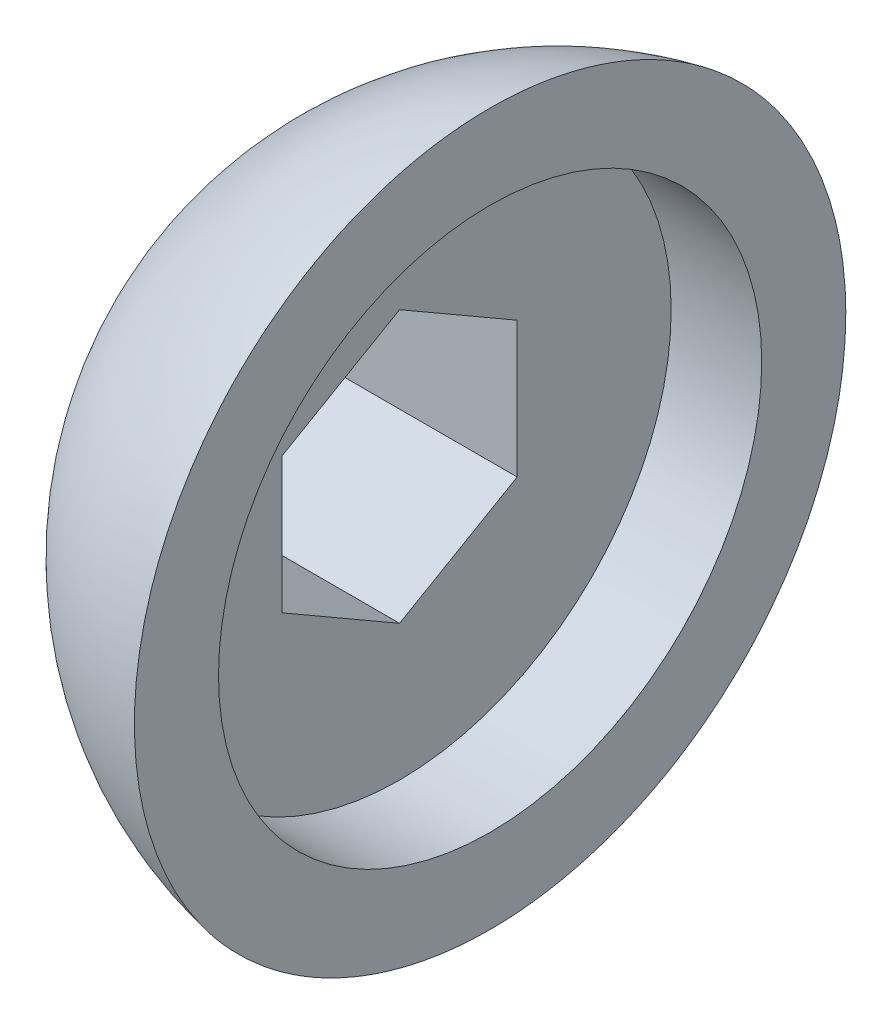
ISO-10303-21;
HEADER;
FILE_DESCRIPTION(('STEP AP214'),'2;1');
FILE_NAME('part.step','',(''),(''),'','','');
FILE_SCHEMA(('AUTOMOTIVE_DESIGN { 1 0 10303 214 1 1 1 1 }'));
ENDSEC;
DATA;
#1=APPLICATION_CONTEXT('core data for automotive mechanical design processes');
#2=APPLICATION_PROTOCOL_DEFINITION('international standard','automotive_design',2000,#1);
#3=PRODUCT_CONTEXT('',#1,'mechanical');
#4=PRODUCT('Part','Part','',(#3));
#5=PRODUCT_RELATED_PRODUCT_CATEGORY('part','',(#4));
#6=PRODUCT_DEFINITION_FORMATION('','',#4);
#7=PRODUCT_DEFINITION_CONTEXT('part definition',#1,'design');
#8=PRODUCT_DEFINITION('design','',#6,#7);
#9=PRODUCT_DEFINITION_SHAPE('','',#8);
#10=(LENGTH_UNIT() NAMED_UNIT(*) SI_UNIT(.MILLI.,.METRE.));
#11=(NAMED_UNIT(*) PLANE_ANGLE_UNIT() SI_UNIT($,.RADIAN.));
#12=(NAMED_UNIT(*) SI_UNIT($,.STERADIAN.) SOLID_ANGLE_UNIT());
#13=UNCERTAINTY_MEASURE_WITH_UNIT(LENGTH_MEASURE(1.E-05),#10,'distance_accuracy_value','');
#14=(GEOMETRIC_REPRESENTATION_CONTEXT(3) GLOBAL_UNCERTAINTY_ASSIGNED_CONTEXT((#13)) GLOBAL_UNIT_ASSIGNED_CONTEXT((#10,
#11,#12)) REPRESENTATION_CONTEXT('',''));
#15=CARTESIAN_POINT('',(0.,0.,0.));
#16=DIRECTION('',(0.,0.,1.));
#17=DIRECTION('',(1.,0.,0.));
#18=AXIS2_PLACEMENT_3D('',#15,#16,#17);
#19=CARTESIAN_POINT('',(1.92607341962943,0.952499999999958,1.64977839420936));
#20=DIRECTION('',(0.,0.,1.));
#21=DIRECTION('',(1.,0.,0.));
#22=AXIS2_PLACEMENT_3D('',#19,#20,#21);
#23=PLANE('',#22);
#24=DIRECTION('',(0.,1.,0.));
#25=VECTOR('',#24,1.);
#26=CARTESIAN_POINT('',(0.656073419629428,0.952499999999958,1.64977839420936));
#27=LINE('',#26,#25);
#28=CARTESIAN_POINT('',(0.656073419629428,-0.952500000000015,1.64977839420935));
#29=VERTEX_POINT('',#28);
#30=CARTESIAN_POINT('',(0.656073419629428,0.952499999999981,1.64977839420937));
#31=VERTEX_POINT('',#30);
#32=EDGE_CURVE('E90',#29,#31,#27,.T.);
#33=ORIENTED_EDGE('',*,*,#32,.F.);
#34=DIRECTION('',(1.,0.,0.));
#35=VECTOR('',#34,1.);
#36=CARTESIAN_POINT('',(1.92607341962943,-0.952500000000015,1.64977839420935));
#37=LINE('',#36,#35);
#38=CARTESIAN_POINT('',(-1.83071261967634,-0.952500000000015,1.64977839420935));
#39=VERTEX_POINT('',#38);
#40=EDGE_CURVE('E39',#29,#39,#37,.F.);
#41=ORIENTED_EDGE('',*,*,#40,.T.);
#42=CARTESIAN_POINT('',(-1.83071261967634,0.952499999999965,1.64977839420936));
#43=CARTESIAN_POINT('',(-1.84350674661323,0.889247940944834,1.64977839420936));
#44=CARTESIAN_POINT('',(-1.85502505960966,0.825737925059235,1.64977839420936));
#45=CARTESIAN_POINT('',(-1.87542994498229,0.698708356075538,1.64977839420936));
#46=CARTESIAN_POINT('',(-1.88433269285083,0.635191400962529,1.64977839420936));
#47=CARTESIAN_POINT('',(-1.89955229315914,0.508153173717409,1.64977839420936));
#48=CARTESIAN_POINT('',(-1.9058811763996,0.44463334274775,1.64977839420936));
#49=CARTESIAN_POINT('',(-1.91598737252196,0.31759315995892,1.64977839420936));
#50=CARTESIAN_POINT('',(-1.91977268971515,0.254073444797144,1.64977839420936));
#51=CARTESIAN_POINT('',(-1.92481369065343,0.127035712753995,1.64977839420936));
#52=CARTESIAN_POINT('',(-1.92607341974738,0.0635178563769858,1.64977839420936));
#53=CARTESIAN_POINT('',(-1.92607341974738,-0.0635178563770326,1.64977839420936));
#54=CARTESIAN_POINT('',(-1.92481369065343,-0.127035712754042,1.64977839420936));
#55=CARTESIAN_POINT('',(-1.91977268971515,-0.254073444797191,1.64977839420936));
#56=CARTESIAN_POINT('',(-1.91598737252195,-0.317593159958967,1.64977839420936));
#57=CARTESIAN_POINT('',(-1.9058811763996,-0.444633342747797,1.64977839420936));
#58=CARTESIAN_POINT('',(-1.89955229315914,-0.508153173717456,1.64977839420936));
#59=CARTESIAN_POINT('',(-1.88433269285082,-0.635191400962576,1.64977839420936));
#60=CARTESIAN_POINT('',(-1.87542994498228,-0.698708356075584,1.64977839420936));
#61=CARTESIAN_POINT('',(-1.85502505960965,-0.825737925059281,1.64977839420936));
#62=CARTESIAN_POINT('',(-1.84350674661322,-0.88924794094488,1.64977839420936));
#63=CARTESIAN_POINT('',(-1.83071261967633,-0.952500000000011,1.64977839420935));
#64=B_SPLINE_CURVE_WITH_KNOTS('',3,(#42,#43,#44,#45,#46,#47,#48,#49,#50,#51,#52,#53,#54,#55,#56,
#57,#58,#59,#60,#61,#62,#63),.UNSPECIFIED.,.F.,.F.,(4,2,2,2,2,2,2,2,2,2,4),(0.,
0.193585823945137,0.385947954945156,0.57740031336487,0.76824733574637,0.958788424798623,
1.14932951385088,1.34017653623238,1.53162889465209,1.72399102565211,1.91757684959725),.UNSPECIFIED.);
#65=CARTESIAN_POINT('',(-1.83071261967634,0.952499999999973,1.64977839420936));
#66=VERTEX_POINT('',#65);
#67=EDGE_CURVE('E173',#66,#39,#64,.T.);
#68=ORIENTED_EDGE('',*,*,#67,.F.);
#69=DIRECTION('',(1.,0.,0.));
#70=VECTOR('',#69,1.);
#71=CARTESIAN_POINT('',(1.92607341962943,0.952499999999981,1.64977839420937));
#72=LINE('',#71,#70);
#73=EDGE_CURVE('E81',#66,#31,#72,.T.);
#74=ORIENTED_EDGE('',*,*,#73,.T.);
#75=EDGE_LOOP('',(#33,#41,#68,#74));
#76=FACE_BOUND('',#75,.T.);
#77=ADVANCED_FACE('F33',(#76),#23,.F.);
#78=CARTESIAN_POINT('',(1.92607341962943,-0.952500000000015,1.64977839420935));
#79=DIRECTION('',(0.,-0.866025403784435,0.500000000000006));
#80=DIRECTION('',(0.,-0.500000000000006,-0.866025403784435));
#81=AXIS2_PLACEMENT_3D('',#78,#79,#80);
#82=PLANE('',#81);
#83=DIRECTION('',(0.,0.500000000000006,0.866025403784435));
#84=VECTOR('',#83,1.);
#85=CARTESIAN_POINT('',(0.656073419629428,-0.952500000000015,1.64977839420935));
#86=LINE('',#85,#84);
#87=CARTESIAN_POINT('',(0.656073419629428,-1.90500000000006,0.));
#88=VERTEX_POINT('',#87);
#89=EDGE_CURVE('E87',#88,#29,#86,.T.);
#90=ORIENTED_EDGE('',*,*,#89,.F.);
#91=DIRECTION('',(1.,0.,0.));
#92=VECTOR('',#91,1.);
#93=CARTESIAN_POINT('',(1.92607341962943,-1.90500000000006,0.));
#94=LINE('',#93,#92);
#95=CARTESIAN_POINT('',(-1.83071261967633,-1.90500000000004,0.));
#96=VERTEX_POINT('',#95);
#97=EDGE_CURVE('E172',#88,#96,#94,.F.);
#98=ORIENTED_EDGE('',*,*,#97,.T.);
#99=CARTESIAN_POINT('',(-1.83071261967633,-0.952500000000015,1.64977839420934));
#100=CARTESIAN_POINT('',(-1.84350674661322,-0.984126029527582,1.59500050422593));
#101=CARTESIAN_POINT('',(-1.85502505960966,-1.01588103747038,1.53999921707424));
#102=CARTESIAN_POINT('',(-1.87542994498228,-1.07939582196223,1.42998838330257));
#103=CARTESIAN_POINT('',(-1.88433269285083,-1.11115429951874,1.37498108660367));
#104=CARTESIAN_POINT('',(-1.89955229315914,-1.1746734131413,1.26496275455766));
#105=CARTESIAN_POINT('',(-1.9058811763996,-1.20643332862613,1.20995296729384));
#106=CARTESIAN_POINT('',(-1.91598737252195,-1.26995342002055,1.09993294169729));
#107=CARTESIAN_POINT('',(-1.91977268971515,-1.30171327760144,1.04492325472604));
#108=CARTESIAN_POINT('',(-1.92481369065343,-1.36523214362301,0.934905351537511));
#109=CARTESIAN_POINT('',(-1.92607341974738,-1.39699107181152,0.879897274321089));
#110=CARTESIAN_POINT('',(-1.92607341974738,-1.46050892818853,0.769881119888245));
#111=CARTESIAN_POINT('',(-1.92481369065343,-1.49226785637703,0.714873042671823));
#112=CARTESIAN_POINT('',(-1.91977268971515,-1.55578672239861,0.604855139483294));
#113=CARTESIAN_POINT('',(-1.91598737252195,-1.5875465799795,0.549845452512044));
#114=CARTESIAN_POINT('',(-1.90588117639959,-1.65106667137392,0.439825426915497));
#115=CARTESIAN_POINT('',(-1.89955229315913,-1.68282658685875,0.384815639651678));
#116=CARTESIAN_POINT('',(-1.88433269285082,-1.74634570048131,0.274797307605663));
#117=CARTESIAN_POINT('',(-1.87542994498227,-1.77810417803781,0.219790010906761));
#118=CARTESIAN_POINT('',(-1.85502505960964,-1.84161896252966,0.109779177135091));
#119=CARTESIAN_POINT('',(-1.84350674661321,-1.87337397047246,0.0547778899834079));
#120=CARTESIAN_POINT('',(-1.83071261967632,-1.90500000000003,0.));
#121=B_SPLINE_CURVE_WITH_KNOTS('',3,(#99,#100,#101,#102,#103,#104,#105,#106,#107,#108,#109,#110,
#111,#112,#113,#114,#115,#116,#117,#118,#119,#120),.UNSPECIFIED.,.F.,.F.,(4,2,2,2,2,2,2,2,2,2,
4),(0.,0.19358582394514,0.385947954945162,0.577400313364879,0.768247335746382,0.958788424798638,
1.14932951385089,1.3401765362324,1.53162889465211,1.72399102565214,1.91757684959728),.UNSPECIFIED.);
#122=EDGE_CURVE('E166',#39,#96,#121,.T.);
#123=ORIENTED_EDGE('',*,*,#122,.F.);
#124=ORIENTED_EDGE('',*,*,#40,.F.);
#125=EDGE_LOOP('',(#90,#98,#123,#124));
#126=FACE_BOUND('',#125,.T.);
#127=ADVANCED_FACE('F178',(#126),#82,.F.);
#128=CARTESIAN_POINT('',(1.92607341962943,1.905,0.));
#129=DIRECTION('',(0.,0.866025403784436,0.500000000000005));
#130=DIRECTION('',(0.,-0.500000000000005,0.866025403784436));
#131=AXIS2_PLACEMENT_3D('',#128,#129,#130);
#132=PLANE('',#131);
#133=DIRECTION('',(0.,0.500000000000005,-0.866025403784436));
#134=VECTOR('',#133,1.);
#135=CARTESIAN_POINT('',(0.656073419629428,1.905,0.));
#136=LINE('',#135,#134);
#137=CARTESIAN_POINT('',(0.656073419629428,1.90499999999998,0.));
#138=VERTEX_POINT('',#137);
#139=EDGE_CURVE('E52',#31,#138,#136,.T.);
#140=ORIENTED_EDGE('',*,*,#139,.F.);
#141=ORIENTED_EDGE('',*,*,#73,.F.);
#142=CARTESIAN_POINT('',(-1.83071261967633,1.905,0.));
#143=CARTESIAN_POINT('',(-1.84350674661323,1.87337397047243,0.0547778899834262));
#144=CARTESIAN_POINT('',(-1.85502505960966,1.84161896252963,0.109779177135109));
#145=CARTESIAN_POINT('',(-1.87542994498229,1.77810417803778,0.21979001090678));
#146=CARTESIAN_POINT('',(-1.88433269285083,1.74634570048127,0.274797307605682));
#147=CARTESIAN_POINT('',(-1.89955229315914,1.68282658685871,0.384815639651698));
#148=CARTESIAN_POINT('',(-1.9058811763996,1.65106667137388,0.439825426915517));
#149=CARTESIAN_POINT('',(-1.91598737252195,1.58754657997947,0.549845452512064));
#150=CARTESIAN_POINT('',(-1.91977268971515,1.55578672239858,0.604855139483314));
#151=CARTESIAN_POINT('',(-1.92481369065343,1.492267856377,0.714873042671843));
#152=CARTESIAN_POINT('',(-1.92607341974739,1.46050892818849,0.769881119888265));
#153=CARTESIAN_POINT('',(-1.92607341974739,1.39699107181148,0.87989727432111));
#154=CARTESIAN_POINT('',(-1.92481369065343,1.36523214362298,0.934905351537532));
#155=CARTESIAN_POINT('',(-1.91977268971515,1.3017132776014,1.04492325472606));
#156=CARTESIAN_POINT('',(-1.91598737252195,1.26995342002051,1.09993294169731));
#157=CARTESIAN_POINT('',(-1.9058811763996,1.2064333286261,1.20995296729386));
#158=CARTESIAN_POINT('',(-1.89955229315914,1.17467341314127,1.26496275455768));
#159=CARTESIAN_POINT('',(-1.88433269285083,1.1111542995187,1.37498108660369));
#160=CARTESIAN_POINT('',(-1.87542994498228,1.0793958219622,1.42998838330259));
#161=CARTESIAN_POINT('',(-1.85502505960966,1.01588103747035,1.53999921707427));
#162=CARTESIAN_POINT('',(-1.84350674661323,0.984126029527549,1.59500050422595));
#163=CARTESIAN_POINT('',(-1.83071261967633,0.952499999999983,1.64977839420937));
#164=B_SPLINE_CURVE_WITH_KNOTS('',3,(#142,#143,#144,#145,#146,#147,#148,#149,#150,#151,#152,
#153,#154,#155,#156,#157,#158,#159,#160,#161,#162,#163),.UNSPECIFIED.,.F.,.F.,(4,2,2,2,2,2,2,2,
2,2,4),(0.,0.19358582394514,0.385947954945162,0.57740031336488,0.768247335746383,
0.958788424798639,1.1493295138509,1.3401765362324,1.53162889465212,1.72399102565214,
1.91757684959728),.UNSPECIFIED.);
#165=CARTESIAN_POINT('',(-1.83071261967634,1.90499999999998,0.));
#166=VERTEX_POINT('',#165);
#167=EDGE_CURVE('E121',#166,#66,#164,.T.);
#168=ORIENTED_EDGE('',*,*,#167,.F.);
#169=DIRECTION('',(1.,0.,0.));
#170=VECTOR('',#169,1.);
#171=CARTESIAN_POINT('',(1.92607341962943,1.90499999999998,0.));
#172=LINE('',#171,#170);
#173=EDGE_CURVE('E113',#166,#138,#172,.T.);
#174=ORIENTED_EDGE('',*,*,#173,.T.);
#175=EDGE_LOOP('',(#140,#141,#168,#174));
#176=FACE_BOUND('',#175,.T.);
#177=ADVANCED_FACE('F156',(#176),#132,.F.);
#178=CARTESIAN_POINT('',(1.92607341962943,-1.90500000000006,0.));
#179=DIRECTION('',(0.,-0.866025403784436,-0.500000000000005));
#180=DIRECTION('',(0.,0.500000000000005,-0.866025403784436));
#181=AXIS2_PLACEMENT_3D('',#178,#179,#180);
#182=PLANE('',#181);
#183=DIRECTION('',(0.,-0.500000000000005,0.866025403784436));
#184=VECTOR('',#183,1.);
#185=CARTESIAN_POINT('',(0.656073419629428,-1.90500000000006,0.));
#186=LINE('',#185,#184);
#187=CARTESIAN_POINT('',(0.656073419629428,-0.952500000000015,-1.64977839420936));
#188=VERTEX_POINT('',#187);
#189=EDGE_CURVE('E106',#188,#88,#186,.T.);
#190=ORIENTED_EDGE('',*,*,#189,.F.);
#191=DIRECTION('',(-1.,0.,0.));
#192=VECTOR('',#191,1.);
#193=CARTESIAN_POINT('',(1.92607341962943,-0.952500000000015,-1.64977839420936));
#194=LINE('',#193,#192);
#195=CARTESIAN_POINT('',(-1.83071261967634,-0.952500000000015,-1.64977839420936));
#196=VERTEX_POINT('',#195);
#197=EDGE_CURVE('E105',#188,#196,#194,.T.);
#198=ORIENTED_EDGE('',*,*,#197,.T.);
#199=CARTESIAN_POINT('',(-1.83071261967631,-1.90500000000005,0.));
#200=CARTESIAN_POINT('',(-1.8435067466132,-1.87337397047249,-0.0547778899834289));
#201=CARTESIAN_POINT('',(-1.85502505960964,-1.84161896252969,-0.109779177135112));
#202=CARTESIAN_POINT('',(-1.87542994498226,-1.77810417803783,-0.219790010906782));
#203=CARTESIAN_POINT('',(-1.88433269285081,-1.74634570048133,-0.274797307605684));
#204=CARTESIAN_POINT('',(-1.89955229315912,-1.68282658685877,-0.3848156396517));
#205=CARTESIAN_POINT('',(-1.90588117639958,-1.65106667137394,-0.439825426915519));
#206=CARTESIAN_POINT('',(-1.91598737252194,-1.58754657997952,-0.549845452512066));
#207=CARTESIAN_POINT('',(-1.91977268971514,-1.55578672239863,-0.604855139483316));
#208=CARTESIAN_POINT('',(-1.92481369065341,-1.49226785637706,-0.714873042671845));
#209=CARTESIAN_POINT('',(-1.92607341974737,-1.46050892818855,-0.769881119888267));
#210=CARTESIAN_POINT('',(-1.92607341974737,-1.39699107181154,-0.879897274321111));
#211=CARTESIAN_POINT('',(-1.92481369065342,-1.36523214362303,-0.934905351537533));
#212=CARTESIAN_POINT('',(-1.91977268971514,-1.30171327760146,-1.04492325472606));
#213=CARTESIAN_POINT('',(-1.91598737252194,-1.26995342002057,-1.09993294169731));
#214=CARTESIAN_POINT('',(-1.90588117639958,-1.20643332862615,-1.20995296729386));
#215=CARTESIAN_POINT('',(-1.89955229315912,-1.17467341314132,-1.26496275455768));
#216=CARTESIAN_POINT('',(-1.88433269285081,-1.11115429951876,-1.37498108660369));
#217=CARTESIAN_POINT('',(-1.87542994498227,-1.07939582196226,-1.4299883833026));
#218=CARTESIAN_POINT('',(-1.85502505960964,-1.01588103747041,-1.53999921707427));
#219=CARTESIAN_POINT('',(-1.84350674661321,-0.984126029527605,-1.59500050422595));
#220=CARTESIAN_POINT('',(-1.83071261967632,-0.952500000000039,-1.64977839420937));
#221=B_SPLINE_CURVE_WITH_KNOTS('',3,(#199,#200,#201,#202,#203,#204,#205,#206,#207,#208,#209,
#210,#211,#212,#213,#214,#215,#216,#217,#218,#219,#220),.UNSPECIFIED.,.F.,.F.,(4,2,2,2,2,2,2,2,
2,2,4),(0.,0.19358582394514,0.385947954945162,0.57740031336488,0.768247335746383,
0.958788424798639,1.1493295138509,1.3401765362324,1.53162889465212,1.72399102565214,
1.91757684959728),.UNSPECIFIED.);
#222=EDGE_CURVE('E116',#96,#196,#221,.T.);
#223=ORIENTED_EDGE('',*,*,#222,.F.);
#224=ORIENTED_EDGE('',*,*,#97,.F.);
#225=EDGE_LOOP('',(#190,#198,#223,#224));
#226=FACE_BOUND('',#225,.T.);
#227=ADVANCED_FACE('F152',(#226),#182,.F.);
#228=CARTESIAN_POINT('',(1.92607341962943,-0.952500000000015,-1.64977839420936));
#229=DIRECTION('',(0.,0.,-1.));
#230=DIRECTION('',(-1.,0.,0.));
#231=AXIS2_PLACEMENT_3D('',#228,#229,#230);
#232=PLANE('',#231);
#233=DIRECTION('',(0.,-1.,0.));
#234=VECTOR('',#233,1.);
#235=CARTESIAN_POINT('',(0.656073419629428,-0.952500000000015,-1.64977839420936));
#236=LINE('',#235,#234);
#237=CARTESIAN_POINT('',(0.656073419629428,0.952499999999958,-1.64977839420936));
#238=VERTEX_POINT('',#237);
#239=EDGE_CURVE('E98',#238,#188,#236,.T.);
#240=ORIENTED_EDGE('',*,*,#239,.F.);
#241=DIRECTION('',(1.,0.,0.));
#242=VECTOR('',#241,1.);
#243=CARTESIAN_POINT('',(1.92607341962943,0.952499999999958,-1.64977839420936));
#244=LINE('',#243,#242);
#245=CARTESIAN_POINT('',(-1.83071261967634,0.952499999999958,-1.64977839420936));
#246=VERTEX_POINT('',#245);
#247=EDGE_CURVE('E61',#238,#246,#244,.F.);
#248=ORIENTED_EDGE('',*,*,#247,.T.);
#249=CARTESIAN_POINT('',(-1.83071261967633,-0.952500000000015,-1.64977839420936));
#250=CARTESIAN_POINT('',(-1.84350674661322,-0.889247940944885,-1.64977839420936));
#251=CARTESIAN_POINT('',(-1.85502505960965,-0.825737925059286,-1.64977839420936));
#252=CARTESIAN_POINT('',(-1.87542994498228,-0.698708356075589,-1.64977839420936));
#253=CARTESIAN_POINT('',(-1.88433269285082,-0.635191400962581,-1.64977839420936));
#254=CARTESIAN_POINT('',(-1.89955229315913,-0.508153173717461,-1.64977839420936));
#255=CARTESIAN_POINT('',(-1.9058811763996,-0.444633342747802,-1.64977839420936));
#256=CARTESIAN_POINT('',(-1.91598737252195,-0.317593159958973,-1.64977839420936));
#257=CARTESIAN_POINT('',(-1.91977268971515,-0.254073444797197,-1.64977839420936));
#258=CARTESIAN_POINT('',(-1.92481369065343,-0.127035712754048,-1.64977839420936));
#259=CARTESIAN_POINT('',(-1.92607341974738,-0.0635178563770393,-1.64977839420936));
#260=CARTESIAN_POINT('',(-1.92607341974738,0.063517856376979,-1.64977839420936));
#261=CARTESIAN_POINT('',(-1.92481369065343,0.127035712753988,-1.64977839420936));
#262=CARTESIAN_POINT('',(-1.91977268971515,0.254073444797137,-1.64977839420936));
#263=CARTESIAN_POINT('',(-1.91598737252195,0.317593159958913,-1.64977839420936));
#264=CARTESIAN_POINT('',(-1.9058811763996,0.444633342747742,-1.64977839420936));
#265=CARTESIAN_POINT('',(-1.89955229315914,0.508153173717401,-1.64977839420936));
#266=CARTESIAN_POINT('',(-1.88433269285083,0.635191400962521,-1.64977839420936));
#267=CARTESIAN_POINT('',(-1.87542994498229,0.69870835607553,-1.64977839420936));
#268=CARTESIAN_POINT('',(-1.85502505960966,0.825737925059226,-1.64977839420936));
#269=CARTESIAN_POINT('',(-1.84350674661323,0.889247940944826,-1.64977839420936));
#270=CARTESIAN_POINT('',(-1.83071261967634,0.952499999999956,-1.64977839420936));
#271=B_SPLINE_CURVE_WITH_KNOTS('',3,(#249,#250,#251,#252,#253,#254,#255,#256,#257,#258,#259,
#260,#261,#262,#263,#264,#265,#266,#267,#268,#269,#270),.UNSPECIFIED.,.F.,.F.,(4,2,2,2,2,2,2,2,
2,2,4),(0.,0.193585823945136,0.385947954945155,0.577400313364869,0.768247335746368,
0.958788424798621,1.14932951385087,1.34017653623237,1.53162889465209,1.7239910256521,
1.91757684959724),.UNSPECIFIED.);
#272=EDGE_CURVE('E140',#196,#246,#271,.T.);
#273=ORIENTED_EDGE('',*,*,#272,.F.);
#274=ORIENTED_EDGE('',*,*,#197,.F.);
#275=EDGE_LOOP('',(#240,#248,#273,#274));
#276=FACE_BOUND('',#275,.T.);
#277=ADVANCED_FACE('F104',(#276),#232,.F.);
#278=CARTESIAN_POINT('',(1.92607341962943,0.952499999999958,-1.64977839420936));
#279=DIRECTION('',(0.,0.866025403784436,-0.500000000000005));
#280=DIRECTION('',(0.,0.500000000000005,0.866025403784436));
#281=AXIS2_PLACEMENT_3D('',#278,#279,#280);
#282=PLANE('',#281);
#283=DIRECTION('',(0.,-0.500000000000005,-0.866025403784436));
#284=VECTOR('',#283,1.);
#285=CARTESIAN_POINT('',(0.656073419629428,0.952499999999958,-1.64977839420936));
#286=LINE('',#285,#284);
#287=EDGE_CURVE('E11',#138,#238,#286,.T.);
#288=ORIENTED_EDGE('',*,*,#287,.F.);
#289=ORIENTED_EDGE('',*,*,#173,.F.);
#290=CARTESIAN_POINT('',(-1.83071261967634,0.952499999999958,-1.64977839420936));
#291=CARTESIAN_POINT('',(-1.84350674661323,0.984126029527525,-1.59500050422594));
#292=CARTESIAN_POINT('',(-1.85502505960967,1.01588103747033,-1.53999921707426));
#293=CARTESIAN_POINT('',(-1.87542994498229,1.07939582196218,-1.42998838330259));
#294=CARTESIAN_POINT('',(-1.88433269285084,1.11115429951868,-1.37498108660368));
#295=CARTESIAN_POINT('',(-1.89955229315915,1.17467341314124,-1.26496275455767));
#296=CARTESIAN_POINT('',(-1.90588117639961,1.20643332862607,-1.20995296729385));
#297=CARTESIAN_POINT('',(-1.91598737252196,1.26995342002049,-1.0999329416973));
#298=CARTESIAN_POINT('',(-1.91977268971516,1.30171327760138,-1.04492325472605));
#299=CARTESIAN_POINT('',(-1.92481369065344,1.36523214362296,-0.93490535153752));
#300=CARTESIAN_POINT('',(-1.92607341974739,1.39699107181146,-0.879897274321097));
#301=CARTESIAN_POINT('',(-1.92607341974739,1.46050892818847,-0.769881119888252));
#302=CARTESIAN_POINT('',(-1.92481369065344,1.49226785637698,-0.714873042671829));
#303=CARTESIAN_POINT('',(-1.91977268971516,1.55578672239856,-0.6048551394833));
#304=CARTESIAN_POINT('',(-1.91598737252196,1.58754657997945,-0.549845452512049));
#305=CARTESIAN_POINT('',(-1.90588117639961,1.65106667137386,-0.439825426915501));
#306=CARTESIAN_POINT('',(-1.89955229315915,1.68282658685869,-0.384815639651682));
#307=CARTESIAN_POINT('',(-1.88433269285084,1.74634570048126,-0.274797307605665));
#308=CARTESIAN_POINT('',(-1.87542994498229,1.77810417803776,-0.219790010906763));
#309=CARTESIAN_POINT('',(-1.85502505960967,1.84161896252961,-0.109779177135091));
#310=CARTESIAN_POINT('',(-1.84350674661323,1.87337397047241,-0.0547778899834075));
#311=CARTESIAN_POINT('',(-1.83071261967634,1.90499999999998,0.));
#312=B_SPLINE_CURVE_WITH_KNOTS('',3,(#290,#291,#292,#293,#294,#295,#296,#297,#298,#299,#300,
#301,#302,#303,#304,#305,#306,#307,#308,#309,#310,#311),.UNSPECIFIED.,.F.,.F.,(4,2,2,2,2,2,2,2,
2,2,4),(0.,0.193585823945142,0.385947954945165,0.577400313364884,0.768247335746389,
0.958788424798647,1.14932951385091,1.34017653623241,1.53162889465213,1.72399102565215,
1.91757684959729),.UNSPECIFIED.);
#313=EDGE_CURVE('E45',#246,#166,#312,.T.);
#314=ORIENTED_EDGE('',*,*,#313,.F.);
#315=ORIENTED_EDGE('',*,*,#247,.F.);
#316=EDGE_LOOP('',(#288,#289,#314,#315));
#317=FACE_BOUND('',#316,.T.);
#318=ADVANCED_FACE('F109',(#317),#282,.F.);
#319=CARTESIAN_POINT('',(1.92607341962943,-0.461818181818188,0.));
#320=DIRECTION('',(1.,0.,0.));
#321=DIRECTION('',(0.,0.,-1.));
#322=AXIS2_PLACEMENT_3D('',#319,#320,#321);
#323=PLANE('',#322);
#324=CARTESIAN_POINT('',(1.92607341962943,-2.34289150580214E-10,0.));
#325=DIRECTION('',(1.,0.,0.));
#326=DIRECTION('',(0.,0.,-1.));
#327=AXIS2_PLACEMENT_3D('',#324,#325,#326);
#328=CIRCLE('',#327,3.81);
#329=CARTESIAN_POINT('',(1.92607341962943,-2.34289150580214E-10,-3.81));
#330=VERTEX_POINT('',#329);
#331=EDGE_CURVE('E209',#330,#330,#328,.T.);
#332=ORIENTED_EDGE('',*,*,#331,.F.);
#333=EDGE_LOOP('',(#332));
#334=FACE_BOUND('',#333,.T.);
#335=CARTESIAN_POINT('',(1.92607341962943,4.9899041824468,0.));
#336=CARTESIAN_POINT('',(1.92607341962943,4.98990478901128,-0.170465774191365));
#337=CARTESIAN_POINT('',(1.92607341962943,4.98116284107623,-0.34092210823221));
#338=CARTESIAN_POINT('',(1.92607341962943,4.94626927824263,-0.680188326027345));
#339=CARTESIAN_POINT('',(1.92607341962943,4.9201047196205,-0.848996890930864));
#340=CARTESIAN_POINT('',(1.92607341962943,4.85682965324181,-1.15326359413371));
#341=CARTESIAN_POINT('',(1.92607341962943,4.82249809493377,-1.28930750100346));
#342=CARTESIAN_POINT('',(1.92607341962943,4.74249125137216,-1.55806915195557));
#343=CARTESIAN_POINT('',(1.92607341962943,4.69681272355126,-1.69078593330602));
#344=CARTESIAN_POINT('',(1.92607341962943,4.5944039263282,-1.95199709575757));
#345=CARTESIAN_POINT('',(1.92607341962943,4.53766540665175,-2.08048824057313));
#346=CARTESIAN_POINT('',(1.92607341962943,4.41353914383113,-2.33227870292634));
#347=CARTESIAN_POINT('',(1.92607341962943,4.34614751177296,-2.45557610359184));
#348=CARTESIAN_POINT('',(1.92607341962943,4.20126701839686,-2.6959556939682));
#349=CARTESIAN_POINT('',(1.92607341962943,4.12378615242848,-2.81304270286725));
#350=CARTESIAN_POINT('',(1.92607341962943,3.95920639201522,-3.04031586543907));
#351=CARTESIAN_POINT('',(1.92607341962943,3.87210396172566,-3.15049945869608));
#352=CARTESIAN_POINT('',(1.92607341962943,3.68897912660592,-3.36307080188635));
#353=CARTESIAN_POINT('',(1.92607341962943,3.59296211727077,-3.46546319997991));
#354=CARTESIAN_POINT('',(1.92607341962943,3.39260916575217,-3.66183424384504));
#355=CARTESIAN_POINT('',(1.92607341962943,3.28827016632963,-3.75580977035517));
#356=CARTESIAN_POINT('',(1.92607341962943,3.07207474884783,-3.9346120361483));
#357=CARTESIAN_POINT('',(1.92607341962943,2.96022038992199,-4.01944126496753));
#358=CARTESIAN_POINT('',(1.92607341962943,2.72972424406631,-4.17940652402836));
#359=CARTESIAN_POINT('',(1.92607341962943,2.61107996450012,-4.25453896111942));
#360=CARTESIAN_POINT('',(1.92607341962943,2.36791389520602,-4.39451851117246));
#361=CARTESIAN_POINT('',(1.92607341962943,2.24339406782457,-4.45936902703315));
#362=CARTESIAN_POINT('',(1.92607341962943,1.98932220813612,-4.578367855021));
#363=CARTESIAN_POINT('',(1.92607341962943,1.85976830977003,-4.6325121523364));
#364=CARTESIAN_POINT('',(1.92607341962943,1.46504568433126,-4.77820896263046));
#365=CARTESIAN_POINT('',(1.92607341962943,1.19354633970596,-4.8531802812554));
#366=CARTESIAN_POINT('',(1.92607341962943,0.641808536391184,-4.9564092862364));
#367=CARTESIAN_POINT('',(1.92607341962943,0.361570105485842,-4.98466712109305));
#368=CARTESIAN_POINT('',(1.92607341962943,-0.0591235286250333,-4.99153389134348));
#369=CARTESIAN_POINT('',(1.92607341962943,-0.199486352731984,-4.9878912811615));
#370=CARTESIAN_POINT('',(1.92607341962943,-0.479388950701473,-4.96880010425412));
#371=CARTESIAN_POINT('',(1.92607341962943,-0.618929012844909,-4.95335595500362));
#372=CARTESIAN_POINT('',(1.92607341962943,-0.896254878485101,-4.91076046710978));
#373=CARTESIAN_POINT('',(1.92607341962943,-1.03404000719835,-4.88360475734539));
#374=CARTESIAN_POINT('',(1.92607341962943,-1.30678430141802,-4.81779290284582));
#375=CARTESIAN_POINT('',(1.92607341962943,-1.44174449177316,-4.77914100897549));
#376=CARTESIAN_POINT('',(1.92607341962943,-1.70798002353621,-4.6905902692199));
#377=CARTESIAN_POINT('',(1.92607341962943,-1.83925393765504,-4.64068713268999));
#378=CARTESIAN_POINT('',(1.92607341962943,-2.09708266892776,-4.53001780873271));
#379=CARTESIAN_POINT('',(1.92607341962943,-2.22363920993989,-4.46925563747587));
#380=CARTESIAN_POINT('',(1.92607341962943,-2.47122708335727,-4.33726498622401));
#381=CARTESIAN_POINT('',(1.92607341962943,-2.59225651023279,-4.26603293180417));
#382=CARTESIAN_POINT('',(1.92607341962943,-2.82783967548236,-4.11365276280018));
#383=CARTESIAN_POINT('',(1.92607341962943,-2.94239578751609,-4.03250831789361));
#384=CARTESIAN_POINT('',(1.92607341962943,-3.16430025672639,-3.86083308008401));
#385=CARTESIAN_POINT('',(1.92607341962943,-3.27164641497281,-3.77029944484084));
#386=CARTESIAN_POINT('',(1.92607341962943,-3.47829131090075,-3.5805451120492));
#387=CARTESIAN_POINT('',(1.92607341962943,-3.57759300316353,-3.48132763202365));
#388=CARTESIAN_POINT('',(1.92607341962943,-3.7675375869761,-3.27482745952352));
#389=CARTESIAN_POINT('',(1.92607341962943,-3.8581758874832,-3.16754054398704));
#390=CARTESIAN_POINT('',(1.92607341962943,-4.03005791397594,-2.94575173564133));
#391=CARTESIAN_POINT('',(1.92607341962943,-4.11130508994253,-2.83125251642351));
#392=CARTESIAN_POINT('',(1.92607341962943,-4.26390639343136,-2.59575472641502));
#393=CARTESIAN_POINT('',(1.92607341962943,-4.33525527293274,-2.47475275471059));
#394=CARTESIAN_POINT('',(1.92607341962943,-4.46749354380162,-2.22718176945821));
#395=CARTESIAN_POINT('',(1.92607341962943,-4.52838416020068,-2.10061341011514));
#396=CARTESIAN_POINT('',(1.92607341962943,-4.63923324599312,-1.84290863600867));
#397=CARTESIAN_POINT('',(1.92607341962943,-4.6892015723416,-1.71177646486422));
#398=CARTESIAN_POINT('',(1.92607341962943,-4.77794018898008,-1.44572284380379));
#399=CARTESIAN_POINT('',(1.92607341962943,-4.81670516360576,-1.31079962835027));
#400=CARTESIAN_POINT('',(1.92607341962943,-4.89622730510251,-0.982404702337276));
#401=CARTESIAN_POINT('',(1.92607341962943,-4.93132742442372,-0.787534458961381));
#402=CARTESIAN_POINT('',(1.92607341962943,-4.97816045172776,-0.395100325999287));
#403=CARTESIAN_POINT('',(1.92607341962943,-4.98990268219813,-0.197537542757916));
#404=CARTESIAN_POINT('',(1.92607341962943,-4.98990547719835,0.170479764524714));
#405=CARTESIAN_POINT('',(1.92607341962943,-4.98116214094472,0.340940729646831));
#406=CARTESIAN_POINT('',(1.92607341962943,-4.94626646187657,0.680203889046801));
#407=CARTESIAN_POINT('',(1.92607341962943,-4.92010292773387,0.849004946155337));
#408=CARTESIAN_POINT('',(1.92607341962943,-4.85683010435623,1.15326188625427));
#409=CARTESIAN_POINT('',(1.92607341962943,-4.82249910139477,1.2893036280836));
#410=CARTESIAN_POINT('',(1.92607341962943,-4.74249373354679,1.55806130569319));
#411=CARTESIAN_POINT('',(1.92607341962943,-4.69681612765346,1.69077627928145));
#412=CARTESIAN_POINT('',(1.92607341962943,-4.59440798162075,1.95198772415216));
#413=CARTESIAN_POINT('',(1.92607341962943,-4.53766886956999,2.08048083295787));
#414=CARTESIAN_POINT('',(1.92607341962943,-4.4135411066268,2.33227510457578));
#415=CARTESIAN_POINT('',(1.92607341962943,-4.34614856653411,2.45557435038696));
#416=CARTESIAN_POINT('',(1.92607341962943,-4.20126580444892,2.69595771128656));
#417=CARTESIAN_POINT('',(1.92607341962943,-4.12378355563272,2.81304663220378));
#418=CARTESIAN_POINT('',(1.92607341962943,-3.95920073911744,3.04032332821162));
#419=CARTESIAN_POINT('',(1.92607341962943,-3.87209663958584,3.1505085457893));
#420=CARTESIAN_POINT('',(1.92607341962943,-3.68897133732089,3.36307925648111));
#421=CARTESIAN_POINT('',(1.92607341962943,-3.5929558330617,3.46546965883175));
#422=CARTESIAN_POINT('',(1.92607341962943,-3.39260584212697,3.6618372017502));
#423=CARTESIAN_POINT('',(1.92607341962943,-3.28826828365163,3.75581120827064));
#424=CARTESIAN_POINT('',(1.92607341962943,-3.07208290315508,3.93460541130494));
#425=CARTESIAN_POINT('',(1.92607341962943,-2.96023757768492,4.01942862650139));
#426=CARTESIAN_POINT('',(1.92607341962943,-2.72975890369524,4.17938318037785));
#427=CARTESIAN_POINT('',(1.92607341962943,-2.61112311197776,4.2545109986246));
#428=CARTESIAN_POINT('',(1.92607341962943,-2.36796643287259,4.39449138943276));
#429=CARTESIAN_POINT('',(1.92607341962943,-2.24344666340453,4.45934590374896));
#430=CARTESIAN_POINT('',(1.92607341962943,-1.98933683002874,4.57835949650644));
#431=CARTESIAN_POINT('',(1.92607341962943,-1.85974472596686,4.63251421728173));
#432=CARTESIAN_POINT('',(1.92607341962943,-1.59018160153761,4.73202676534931));
#433=CARTESIAN_POINT('',(1.92607341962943,-1.45001021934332,4.77684280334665));
#434=CARTESIAN_POINT('',(1.92607341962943,-1.16618659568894,4.8539458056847));
#435=CARTESIAN_POINT('',(1.92607341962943,-1.02253258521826,4.88622625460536));
#436=CARTESIAN_POINT('',(1.92607341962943,-0.732935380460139,4.93797382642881));
#437=CARTESIAN_POINT('',(1.92607341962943,-0.586992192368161,4.95744098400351));
#438=CARTESIAN_POINT('',(1.92607341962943,-0.294031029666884,4.98340269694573));
#439=CARTESIAN_POINT('',(1.92607341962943,-0.147013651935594,4.98990397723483));
#440=CARTESIAN_POINT('',(1.92607341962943,0.140327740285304,4.9899043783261));
#441=CARTESIAN_POINT('',(1.92607341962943,0.280652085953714,4.98398136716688));
#442=CARTESIAN_POINT('',(1.92607341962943,0.56024753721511,4.96033675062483));
#443=CARTESIAN_POINT('',(1.92607341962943,0.69951904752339,4.94261993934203));
#444=CARTESIAN_POINT('',(1.92607341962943,0.976106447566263,4.89551271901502));
#445=CARTESIAN_POINT('',(1.92607341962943,1.1134218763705,4.86611960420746));
#446=CARTESIAN_POINT('',(1.92607341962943,1.38503900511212,4.79588164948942));
#447=CARTESIAN_POINT('',(1.92607341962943,1.51934177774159,4.75504095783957));
#448=CARTESIAN_POINT('',(1.92607341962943,1.78408945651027,4.66217291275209));
#449=CARTESIAN_POINT('',(1.92607341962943,1.91453262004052,4.61014059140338));
#450=CARTESIAN_POINT('',(1.92607341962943,2.17052339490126,4.49529143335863));
#451=CARTESIAN_POINT('',(1.92607341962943,2.29607280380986,4.4324786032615));
#452=CARTESIAN_POINT('',(1.92607341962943,2.54147990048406,4.29647659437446));
#453=CARTESIAN_POINT('',(1.92607341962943,2.66133549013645,4.22328362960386));
#454=CARTESIAN_POINT('',(1.92607341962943,2.89441035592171,4.06708808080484));
#455=CARTESIAN_POINT('',(1.92607341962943,3.00763206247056,3.98408912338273));
#456=CARTESIAN_POINT('',(1.92607341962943,3.22671276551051,3.80882557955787));
#457=CARTESIAN_POINT('',(1.92607341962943,3.33256971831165,3.71655843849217));
#458=CARTESIAN_POINT('',(1.92607341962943,3.53609614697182,3.52346947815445));
#459=CARTESIAN_POINT('',(1.92607341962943,3.63376863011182,3.42265082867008));
#460=CARTESIAN_POINT('',(1.92607341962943,3.82032694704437,3.21308832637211));
#461=CARTESIAN_POINT('',(1.92607341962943,3.90920793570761,3.10434016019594));
#462=CARTESIAN_POINT('',(1.92607341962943,4.07746081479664,2.87978026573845));
#463=CARTESIAN_POINT('',(1.92607341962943,4.15683600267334,2.7639710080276));
#464=CARTESIAN_POINT('',(1.92607341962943,4.30559152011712,2.52600965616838));
#465=CARTESIAN_POINT('',(1.92607341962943,4.37496611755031,2.40385397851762));
#466=CARTESIAN_POINT('',(1.92607341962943,4.50316664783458,2.15414268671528));
#467=CARTESIAN_POINT('',(1.92607341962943,4.56199356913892,2.02658757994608));
#468=CARTESIAN_POINT('',(1.92607341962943,4.66864093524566,1.76708632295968));
#469=CARTESIAN_POINT('',(1.92607341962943,4.71647115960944,1.63514419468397));
#470=CARTESIAN_POINT('',(1.92607341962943,4.80085546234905,1.36769928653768));
#471=CARTESIAN_POINT('',(1.92607341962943,4.83740839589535,1.23219614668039));
#472=CARTESIAN_POINT('',(1.92607341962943,4.90859808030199,0.915789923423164));
#473=CARTESIAN_POINT('',(1.92607341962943,4.93906604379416,0.733932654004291));
#474=CARTESIAN_POINT('',(1.92607341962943,4.97971502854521,0.368046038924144));
#475=CARTESIAN_POINT('',(1.92607341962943,4.98990352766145,0.184017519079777));
#476=CARTESIAN_POINT('',(1.92607341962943,4.9899041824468,0.));
#477=B_SPLINE_CURVE_WITH_KNOTS('',3,(#335,#336,#337,#338,#339,#340,#341,#342,#343,#344,#345,
#346,#347,#348,#349,#350,#351,#352,#353,#354,#355,#356,#357,#358,#359,#360,#361,#362,#363,#364,
#365,#366,#367,#368,#369,#370,#371,#372,#373,#374,#375,#376,#377,#378,#379,#380,#381,#382,#383,
#384,#385,#386,#387,#388,#389,#390,#391,#392,#393,#394,#395,#396,#397,#398,#399,#400,#401,#402,
#403,#404,#405,#406,#407,#408,#409,#410,#411,#412,#413,#414,#415,#416,#417,#418,#419,#420,#421,
#422,#423,#424,#425,#426,#427,#428,#429,#430,#431,#432,#433,#434,#435,#436,#437,#438,#439,#440,
#441,#442,#443,#444,#445,#446,#447,#448,#449,#450,#451,#452,#453,#454,#455,#456,#457,#458,#459,
#460,#461,#462,#463,#464,#465,#466,#467,#468,#469,#470,#471,#472,#473,#474,#475,#476),
.UNSPECIFIED.,.T.,.F.,(4,2,2,2,2,2,2,2,2,2,2,2,2,2,2,2,2,2,2,2,2,2,2,2,2,2,2,2,2,2,2,2,2,2,2,2,
2,2,2,2,2,2,2,2,2,2,2,2,2,2,2,2,2,2,2,2,2,2,2,2,2,2,2,2,2,2,2,2,2,2,4),(0.,0.511163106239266,
1.02270639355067,1.4431552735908,1.86372444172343,2.28460854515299,2.70564664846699,
3.12635310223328,3.54721467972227,3.967823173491,4.38858690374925,4.8092358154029,
5.23004015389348,5.65070493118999,6.07152715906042,6.91225049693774,7.7529711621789,
8.17378458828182,8.59444057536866,9.0152537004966,9.43591141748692,9.85672982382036,
10.2773929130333,10.6981999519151,11.118851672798,11.5396311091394,11.9602552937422,
12.3811011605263,12.8017919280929,13.2227048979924,13.6435685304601,14.0640507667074,
14.4847321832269,15.077291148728,15.669613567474,16.1808024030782,16.6923199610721,
17.1127627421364,17.5333257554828,17.9542159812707,18.3752602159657,18.7959737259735,
19.2168421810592,19.637443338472,20.0582004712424,20.4788183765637,20.8995885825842,
21.320279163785,21.7411407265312,22.1820460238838,22.6231801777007,23.0643131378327,
23.5052172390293,23.926069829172,24.3467514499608,24.7675306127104,25.1881574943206,
25.6089714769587,26.029629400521,26.4504411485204,26.8710977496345,27.2918706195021,
27.7124881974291,28.1333363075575,28.5540380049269,28.974979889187,29.3958823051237,
29.8164089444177,30.2369782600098,30.7889815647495,31.3407812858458),.UNSPECIFIED.);
#478=CARTESIAN_POINT('',(1.92607341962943,4.9899041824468,0.));
#479=VERTEX_POINT('',#478);
#480=EDGE_CURVE('E112',#479,#479,#477,.T.);
#481=ORIENTED_EDGE('',*,*,#480,.F.);
#482=EDGE_LOOP('',(#481));
#483=FACE_BOUND('',#482,.T.);
#484=ADVANCED_FACE('F148',(#334,#483),#323,.T.);
#485=CARTESIAN_POINT('',(2.87857341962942,0.,0.));
#486=DIRECTION('',(0.,1.,0.));
#487=DIRECTION('',(0.,0.,-1.));
#488=AXIS2_PLACEMENT_3D('',#485,#486,#487);
#489=SPHERICAL_SURFACE('',#488,5.08);
#490=ORIENTED_EDGE('',*,*,#480,.T.);
#491=EDGE_LOOP('',(#490));
#492=FACE_BOUND('',#491,.T.);
#493=ORIENTED_EDGE('',*,*,#272,.T.);
#494=ORIENTED_EDGE('',*,*,#313,.T.);
#495=ORIENTED_EDGE('',*,*,#167,.T.);
#496=ORIENTED_EDGE('',*,*,#67,.T.);
#497=ORIENTED_EDGE('',*,*,#122,.T.);
#498=ORIENTED_EDGE('',*,*,#222,.T.);
#499=EDGE_LOOP('',(#493,#494,#495,#496,#497,#498));
#500=FACE_BOUND('',#499,.T.);
#501=ADVANCED_FACE('F35',(#492,#500),#489,.T.);
#502=CARTESIAN_POINT('',(0.656073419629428,-2.34289150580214E-10,0.));
#503=DIRECTION('',(1.,0.,0.));
#504=DIRECTION('',(0.,0.,-1.));
#505=AXIS2_PLACEMENT_3D('',#502,#503,#504);
#506=PLANE('',#505);
#507=CARTESIAN_POINT('',(0.656073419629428,-2.34289150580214E-10,0.));
#508=DIRECTION('',(1.,0.,0.));
#509=DIRECTION('',(0.,0.,-1.));
#510=AXIS2_PLACEMENT_3D('',#507,#508,#509);
#511=CIRCLE('',#510,3.81);
#512=CARTESIAN_POINT('',(0.656073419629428,-2.34289150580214E-10,-3.81));
#513=VERTEX_POINT('',#512);
#514=EDGE_CURVE('E107',#513,#513,#511,.T.);
#515=ORIENTED_EDGE('',*,*,#514,.T.);
#516=EDGE_LOOP('',(#515));
#517=FACE_BOUND('',#516,.T.);
#518=ORIENTED_EDGE('',*,*,#32,.T.);
#519=ORIENTED_EDGE('',*,*,#139,.T.);
#520=ORIENTED_EDGE('',*,*,#287,.T.);
#521=ORIENTED_EDGE('',*,*,#239,.T.);
#522=ORIENTED_EDGE('',*,*,#189,.T.);
#523=ORIENTED_EDGE('',*,*,#89,.T.);
#524=EDGE_LOOP('',(#518,#519,#520,#521,#522,#523));
#525=FACE_BOUND('',#524,.T.);
#526=ADVANCED_FACE('F97',(#517,#525),#506,.T.);
#527=CARTESIAN_POINT('',(0.656073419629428,-2.34289150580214E-10,0.));
#528=DIRECTION('',(1.,0.,0.));
#529=DIRECTION('',(0.,0.,-1.));
#530=AXIS2_PLACEMENT_3D('',#527,#528,#529);
#531=CYLINDRICAL_SURFACE('',#530,3.81);
#532=ORIENTED_EDGE('',*,*,#514,.F.);
#533=EDGE_LOOP('',(#532));
#534=FACE_BOUND('',#533,.T.);
#535=ORIENTED_EDGE('',*,*,#331,.T.);
#536=EDGE_LOOP('',(#535));
#537=FACE_BOUND('',#536,.T.);
#538=ADVANCED_FACE('F216',(#534,#537),#531,.F.);
#539=CLOSED_SHELL('',(#77,#127,#177,#227,#277,#318,#484,#501,#526,#538));
#540=MANIFOLD_SOLID_BREP('B2',#539);
#541=ADVANCED_BREP_SHAPE_REPRESENTATION('',(#18,#540),#14);
#542=SHAPE_DEFINITION_REPRESENTATION(#9,#541);
ENDSEC;
END-ISO-10303-21;
